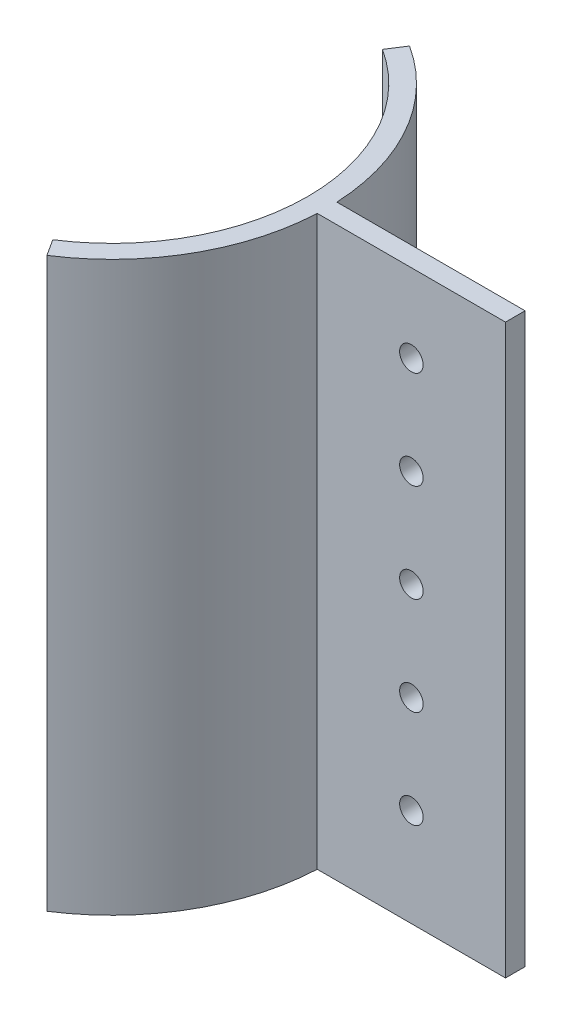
from build123d import *

# Parameters (mm, degrees)
EXTRUDE_THIN1_DEPTH = 36.25
SKETCH2_W           = 25
SKETCH2_H           = 72.5
BOSS_EXTRUDE1_DEPTH = 1.25
LPATTERN1_COUNT     = 5
LPATTERN1_PITCH     = 12.5


with BuildPart() as part:
    # Sketch1 → Extrude-Thin1 (new, symmetric)
    with BuildSketch(Plane(origin=(0, 0, 0), x_dir=(1, 0, 0), z_dir=(0, 1, 0))):
        with BuildLine():
            ThreePointArc((13.507557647, 21.03677462), (25, 0), (13.507557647, -21.03677462))
            Line((13.507557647, -21.03677462), (14.858313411, -23.140452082))
            ThreePointArc((14.858313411, -23.140452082), (27.5, 0), (14.858313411, 23.140452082))
            Line((14.858313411, 23.140452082), (13.507557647, 21.03677462))
        make_face()
    extrude(amount=EXTRUDE_THIN1_DEPTH, both=True)

    # Sketch2 → Boss-Extrude1 (add, symmetric)
    with BuildSketch(Plane.XY):
        with Locations((39, 0)):
            Rectangle(SKETCH2_W, SKETCH2_H)
    extrude(amount=BOSS_EXTRUDE1_DEPTH, both=True)

    # Sketch4 → 3.0mm Dowel Hole1 (revolve, cut)
    with BuildSketch(Plane(origin=(39.48578811, 26.25, 1.25), x_dir=(0, -1, 0), z_dir=(1, 0, 0))):
        Polygon((0, 0), (0, 2.5), (1.525, 2.5), (1.5, 2.475), (1.5, 0), align=None)
    f_3_0mm_dowel_hole1 = revolve(axis=Axis((39.48578811, 26.25, 7.6), (0, 0, -1)), mode=Mode.SUBTRACT)

    # LPattern1: 3.0mm Dowel Hole1 ×5
    with Locations(*[(0, -i * LPATTERN1_PITCH, 0) for i in range(1, LPATTERN1_COUNT)]):
        add(f_3_0mm_dowel_hole1, mode=Mode.SUBTRACT)


solid = part.part
